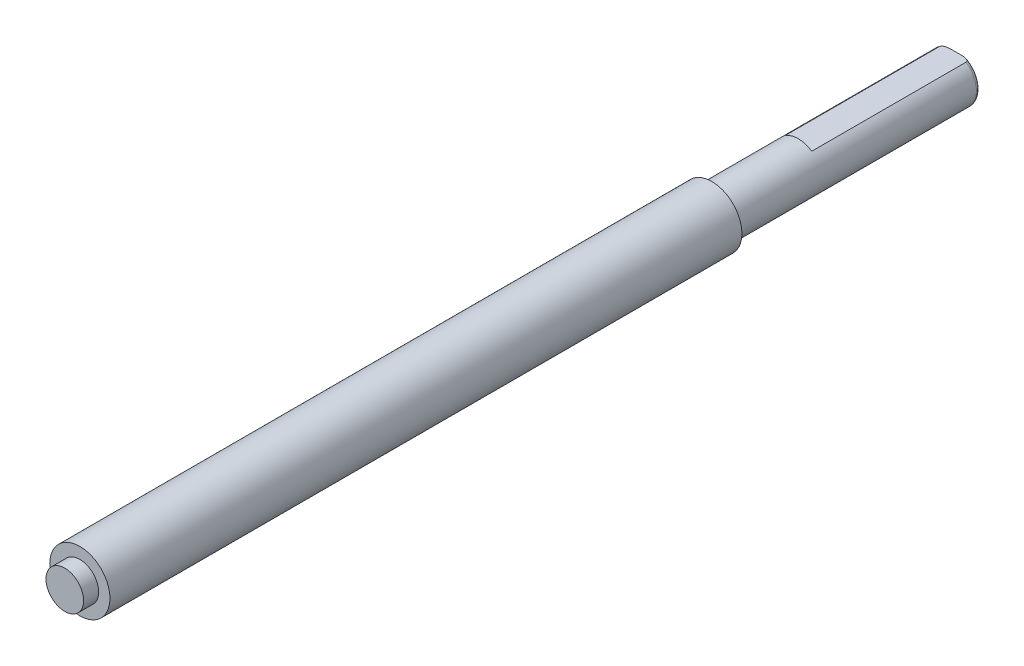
ISO-10303-21;
HEADER;
FILE_DESCRIPTION(('STEP AP214'),'2;1');
FILE_NAME('part.step','',(''),(''),'','','');
FILE_SCHEMA(('AUTOMOTIVE_DESIGN { 1 0 10303 214 1 1 1 1 }'));
ENDSEC;
DATA;
#1=APPLICATION_CONTEXT('core data for automotive mechanical design processes');
#2=APPLICATION_PROTOCOL_DEFINITION('international standard','automotive_design',2000,#1);
#3=PRODUCT_CONTEXT('',#1,'mechanical');
#4=PRODUCT('Part','Part','',(#3));
#5=PRODUCT_RELATED_PRODUCT_CATEGORY('part','',(#4));
#6=PRODUCT_DEFINITION_FORMATION('','',#4);
#7=PRODUCT_DEFINITION_CONTEXT('part definition',#1,'design');
#8=PRODUCT_DEFINITION('design','',#6,#7);
#9=PRODUCT_DEFINITION_SHAPE('','',#8);
#10=(LENGTH_UNIT() NAMED_UNIT(*) SI_UNIT(.MILLI.,.METRE.));
#11=(NAMED_UNIT(*) PLANE_ANGLE_UNIT() SI_UNIT($,.RADIAN.));
#12=(NAMED_UNIT(*) SI_UNIT($,.STERADIAN.) SOLID_ANGLE_UNIT());
#13=UNCERTAINTY_MEASURE_WITH_UNIT(LENGTH_MEASURE(1.E-05),#10,'distance_accuracy_value','');
#14=(GEOMETRIC_REPRESENTATION_CONTEXT(3) GLOBAL_UNCERTAINTY_ASSIGNED_CONTEXT((#13)) GLOBAL_UNIT_ASSIGNED_CONTEXT((#10,
#11,#12)) REPRESENTATION_CONTEXT('',''));
#15=CARTESIAN_POINT('',(0.,0.,0.));
#16=DIRECTION('',(0.,0.,1.));
#17=DIRECTION('',(1.,0.,0.));
#18=AXIS2_PLACEMENT_3D('',#15,#16,#17);
#19=CARTESIAN_POINT('',(0.,0.,116.5));
#20=DIRECTION('',(0.,0.,1.));
#21=DIRECTION('',(1.,0.,0.));
#22=AXIS2_PLACEMENT_3D('',#19,#20,#21);
#23=PLANE('',#22);
#24=CARTESIAN_POINT('',(0.,0.,116.5));
#25=DIRECTION('',(0.,0.,1.));
#26=DIRECTION('',(1.,0.,0.));
#27=AXIS2_PLACEMENT_3D('',#24,#25,#26);
#28=CIRCLE('',#27,4.);
#29=CARTESIAN_POINT('',(-4.,0.,116.5));
#30=VERTEX_POINT('',#29);
#31=EDGE_CURVE('E88',#30,#30,#28,.T.);
#32=ORIENTED_EDGE('',*,*,#31,.T.);
#33=EDGE_LOOP('',(#32));
#34=FACE_BOUND('',#33,.T.);
#35=CARTESIAN_POINT('',(0.,0.,116.5));
#36=DIRECTION('',(0.,0.,1.));
#37=DIRECTION('',(1.,0.,0.));
#38=AXIS2_PLACEMENT_3D('',#35,#36,#37);
#39=CIRCLE('',#38,2.5);
#40=CARTESIAN_POINT('',(2.5,0.,116.5));
#41=VERTEX_POINT('',#40);
#42=EDGE_CURVE('E201',#41,#41,#39,.T.);
#43=ORIENTED_EDGE('',*,*,#42,.F.);
#44=EDGE_LOOP('',(#43));
#45=FACE_BOUND('',#44,.T.);
#46=ADVANCED_FACE('F33',(#34,#45),#23,.T.);
#47=CARTESIAN_POINT('',(0.,0.,32.5));
#48=DIRECTION('',(0.,0.,-1.));
#49=DIRECTION('',(-1.,0.,0.));
#50=AXIS2_PLACEMENT_3D('',#47,#48,#49);
#51=CYLINDRICAL_SURFACE('',#50,3.175);
#52=CARTESIAN_POINT('',(0.,0.,32.5));
#53=DIRECTION('',(0.,0.,1.));
#54=DIRECTION('',(1.,0.,0.));
#55=AXIS2_PLACEMENT_3D('',#52,#53,#54);
#56=CIRCLE('',#55,3.175);
#57=CARTESIAN_POINT('',(3.175,0.,32.5));
#58=VERTEX_POINT('',#57);
#59=EDGE_CURVE('E91',#58,#58,#56,.T.);
#60=ORIENTED_EDGE('',*,*,#59,.F.);
#61=EDGE_LOOP('',(#60));
#62=FACE_BOUND('',#61,.T.);
#63=DIRECTION('',(0.,0.,-1.));
#64=VECTOR('',#63,1.);
#65=CARTESIAN_POINT('',(-1.78605710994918,2.625,21.));
#66=LINE('',#65,#64);
#67=CARTESIAN_POINT('',(-1.78605710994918,2.625,21.));
#68=VERTEX_POINT('',#67);
#69=CARTESIAN_POINT('',(-1.78605710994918,2.625,0.500000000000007));
#70=VERTEX_POINT('',#69);
#71=EDGE_CURVE('E77',#68,#70,#66,.T.);
#72=ORIENTED_EDGE('',*,*,#71,.T.);
#73=CARTESIAN_POINT('',(0.,0.,0.5));
#74=DIRECTION('',(0.,0.,1.));
#75=DIRECTION('',(1.,0.,0.));
#76=AXIS2_PLACEMENT_3D('',#73,#74,#75);
#77=CIRCLE('',#76,3.175);
#78=CARTESIAN_POINT('',(1.78605710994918,2.625,0.500000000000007));
#79=VERTEX_POINT('',#78);
#80=EDGE_CURVE('E82',#70,#79,#77,.T.);
#81=ORIENTED_EDGE('',*,*,#80,.T.);
#82=DIRECTION('',(0.,0.,-1.));
#83=VECTOR('',#82,1.);
#84=CARTESIAN_POINT('',(1.78605710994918,2.625,21.));
#85=LINE('',#84,#83);
#86=CARTESIAN_POINT('',(1.78605710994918,2.625,21.));
#87=VERTEX_POINT('',#86);
#88=EDGE_CURVE('E76',#87,#79,#85,.T.);
#89=ORIENTED_EDGE('',*,*,#88,.F.);
#90=CARTESIAN_POINT('',(0.,0.,21.));
#91=DIRECTION('',(0.,0.,-1.));
#92=DIRECTION('',(-1.,0.,0.));
#93=AXIS2_PLACEMENT_3D('',#90,#91,#92);
#94=CIRCLE('',#93,3.175);
#95=EDGE_CURVE('E66',#68,#87,#94,.T.);
#96=ORIENTED_EDGE('',*,*,#95,.F.);
#97=EDGE_LOOP('',(#72,#81,#89,#96));
#98=FACE_BOUND('',#97,.T.);
#99=ADVANCED_FACE('F80',(#62,#98),#51,.T.);
#100=CARTESIAN_POINT('',(0.,0.,0.));
#101=DIRECTION('',(0.,0.,1.));
#102=DIRECTION('',(1.,0.,0.));
#103=AXIS2_PLACEMENT_3D('',#100,#101,#102);
#104=PLANE('',#103);
#105=DIRECTION('',(-1.,0.,0.));
#106=VECTOR('',#105,1.);
#107=CARTESIAN_POINT('',(1.78605710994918,2.625,0.));
#108=LINE('',#107,#106);
#109=CARTESIAN_POINT('',(0.514781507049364,2.625,0.));
#110=VERTEX_POINT('',#109);
#111=CARTESIAN_POINT('',(-0.514781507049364,2.625,0.));
#112=VERTEX_POINT('',#111);
#113=EDGE_CURVE('E73',#110,#112,#108,.T.);
#114=ORIENTED_EDGE('',*,*,#113,.F.);
#115=CARTESIAN_POINT('',(0.,0.,0.));
#116=DIRECTION('',(0.,0.,1.));
#117=DIRECTION('',(1.,0.,0.));
#118=AXIS2_PLACEMENT_3D('',#115,#116,#117);
#119=CIRCLE('',#118,2.675);
#120=EDGE_CURVE('E11',#110,#112,#119,.F.);
#121=ORIENTED_EDGE('',*,*,#120,.T.);
#122=EDGE_LOOP('',(#114,#121));
#123=FACE_BOUND('',#122,.T.);
#124=ADVANCED_FACE('F118',(#123),#104,.F.);
#125=CARTESIAN_POINT('',(0.,0.,32.5));
#126=DIRECTION('',(0.,0.,1.));
#127=DIRECTION('',(1.,0.,0.));
#128=AXIS2_PLACEMENT_3D('',#125,#126,#127);
#129=PLANE('',#128);
#130=CARTESIAN_POINT('',(0.,0.,32.5));
#131=DIRECTION('',(0.,0.,1.));
#132=DIRECTION('',(1.,0.,0.));
#133=AXIS2_PLACEMENT_3D('',#130,#131,#132);
#134=CIRCLE('',#133,4.);
#135=CARTESIAN_POINT('',(-4.,0.,32.5));
#136=VERTEX_POINT('',#135);
#137=EDGE_CURVE('E84',#136,#136,#134,.T.);
#138=ORIENTED_EDGE('',*,*,#137,.F.);
#139=EDGE_LOOP('',(#138));
#140=FACE_BOUND('',#139,.T.);
#141=ORIENTED_EDGE('',*,*,#59,.T.);
#142=EDGE_LOOP('',(#141));
#143=FACE_BOUND('',#142,.T.);
#144=ADVANCED_FACE('F115',(#140,#143),#129,.F.);
#145=CARTESIAN_POINT('',(0.,0.,116.5));
#146=DIRECTION('',(0.,0.,-1.));
#147=DIRECTION('',(-1.,0.,0.));
#148=AXIS2_PLACEMENT_3D('',#145,#146,#147);
#149=CYLINDRICAL_SURFACE('',#148,4.);
#150=CARTESIAN_POINT('',(-4.,0.,116.5));
#151=CARTESIAN_POINT('',(-4.,0.,115.625));
#152=CARTESIAN_POINT('',(-4.,0.,114.75));
#153=CARTESIAN_POINT('',(-4.,0.,113.));
#154=CARTESIAN_POINT('',(-4.,0.,112.125));
#155=CARTESIAN_POINT('',(-4.,0.,110.375));
#156=CARTESIAN_POINT('',(-4.,0.,109.5));
#157=CARTESIAN_POINT('',(-4.,0.,107.75));
#158=CARTESIAN_POINT('',(-4.,0.,106.875));
#159=CARTESIAN_POINT('',(-4.,0.,105.125));
#160=CARTESIAN_POINT('',(-4.,0.,104.25));
#161=CARTESIAN_POINT('',(-4.,0.,102.5));
#162=CARTESIAN_POINT('',(-4.,0.,101.625));
#163=CARTESIAN_POINT('',(-4.,0.,99.875));
#164=CARTESIAN_POINT('',(-4.,0.,99.));
#165=CARTESIAN_POINT('',(-4.,0.,97.25));
#166=CARTESIAN_POINT('',(-4.,0.,96.375));
#167=CARTESIAN_POINT('',(-4.,0.,94.625));
#168=CARTESIAN_POINT('',(-4.,0.,93.75));
#169=CARTESIAN_POINT('',(-4.,0.,92.));
#170=CARTESIAN_POINT('',(-4.,0.,91.125));
#171=CARTESIAN_POINT('',(-4.,0.,89.375));
#172=CARTESIAN_POINT('',(-4.,0.,88.5));
#173=CARTESIAN_POINT('',(-4.,0.,86.75));
#174=CARTESIAN_POINT('',(-4.,0.,85.875));
#175=CARTESIAN_POINT('',(-4.,0.,84.125));
#176=CARTESIAN_POINT('',(-4.,0.,83.25));
#177=CARTESIAN_POINT('',(-4.,0.,81.5));
#178=CARTESIAN_POINT('',(-4.,0.,80.625));
#179=CARTESIAN_POINT('',(-4.,0.,78.875));
#180=CARTESIAN_POINT('',(-4.,0.,78.));
#181=CARTESIAN_POINT('',(-4.,0.,76.25));
#182=CARTESIAN_POINT('',(-4.,0.,75.375));
#183=CARTESIAN_POINT('',(-4.,0.,73.625));
#184=CARTESIAN_POINT('',(-4.,0.,72.75));
#185=CARTESIAN_POINT('',(-4.,0.,71.));
#186=CARTESIAN_POINT('',(-4.,0.,70.125));
#187=CARTESIAN_POINT('',(-4.,0.,68.375));
#188=CARTESIAN_POINT('',(-4.,0.,67.5));
#189=CARTESIAN_POINT('',(-4.,0.,65.75));
#190=CARTESIAN_POINT('',(-4.,0.,64.875));
#191=CARTESIAN_POINT('',(-4.,0.,63.125));
#192=CARTESIAN_POINT('',(-4.,0.,62.25));
#193=CARTESIAN_POINT('',(-4.,0.,60.5));
#194=CARTESIAN_POINT('',(-4.,0.,59.625));
#195=CARTESIAN_POINT('',(-4.,0.,57.875));
#196=CARTESIAN_POINT('',(-4.,0.,57.));
#197=CARTESIAN_POINT('',(-4.,0.,55.25));
#198=CARTESIAN_POINT('',(-4.,0.,54.375));
#199=CARTESIAN_POINT('',(-4.,0.,52.625));
#200=CARTESIAN_POINT('',(-4.,0.,51.75));
#201=CARTESIAN_POINT('',(-4.,0.,50.));
#202=CARTESIAN_POINT('',(-4.,0.,49.125));
#203=CARTESIAN_POINT('',(-4.,0.,47.375));
#204=CARTESIAN_POINT('',(-4.,0.,46.5));
#205=CARTESIAN_POINT('',(-4.,0.,44.75));
#206=CARTESIAN_POINT('',(-4.,0.,43.875));
#207=CARTESIAN_POINT('',(-4.,0.,42.125));
#208=CARTESIAN_POINT('',(-4.,0.,41.25));
#209=CARTESIAN_POINT('',(-4.,0.,39.5));
#210=CARTESIAN_POINT('',(-4.,0.,38.625));
#211=CARTESIAN_POINT('',(-4.,0.,36.875));
#212=CARTESIAN_POINT('',(-4.,0.,36.));
#213=CARTESIAN_POINT('',(-4.,0.,34.25));
#214=CARTESIAN_POINT('',(-4.,0.,33.375));
#215=CARTESIAN_POINT('',(-4.,0.,32.5));
#216=B_SPLINE_CURVE_WITH_KNOTS('',3,(#150,#151,#152,#153,#154,#155,#156,#157,#158,#159,#160,
#161,#162,#163,#164,#165,#166,#167,#168,#169,#170,#171,#172,#173,#174,#175,#176,#177,#178,#179,
#180,#181,#182,#183,#184,#185,#186,#187,#188,#189,#190,#191,#192,#193,#194,#195,#196,#197,#198,
#199,#200,#201,#202,#203,#204,#205,#206,#207,#208,#209,#210,#211,#212,#213,#214,#215),
.UNSPECIFIED.,.F.,.F.,(4,2,2,2,2,2,2,2,2,2,2,2,2,2,2,2,2,2,2,2,2,2,2,2,2,2,2,2,2,2,2,2,4),(0.,
2.62499999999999,5.24999999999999,7.87499999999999,10.5,13.125,15.75,18.375,21.,23.625,26.25,
28.875,31.5,34.125,36.75,39.375,42.,44.625,47.25,49.875,52.5,55.125,57.75,60.375,63.,65.625,
68.25,70.875,73.5,76.125,78.75,81.375,84.),.UNSPECIFIED.);
#217=EDGE_CURVE('BSEAM109',#30,#136,#216,.T.);
#218=ORIENTED_EDGE('',*,*,#31,.F.);
#219=ORIENTED_EDGE('',*,*,#137,.T.);
#220=ORIENTED_EDGE('',*,*,#217,.T.);
#221=ORIENTED_EDGE('',*,*,#217,.F.);
#222=EDGE_LOOP('',(#218,#220,#219,#221));
#223=FACE_BOUND('',#222,.T.);
#224=ADVANCED_FACE('F109',(#223),#149,.T.);
#225=CARTESIAN_POINT('',(1.78605710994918,2.625,21.));
#226=DIRECTION('',(0.,-1.,0.));
#227=DIRECTION('',(0.,0.,-1.));
#228=AXIS2_PLACEMENT_3D('',#225,#226,#227);
#229=PLANE('',#228);
#230=ORIENTED_EDGE('',*,*,#88,.T.);
#231=CARTESIAN_POINT('',(1.78605710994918,2.625,0.5));
#232=CARTESIAN_POINT('',(1.7861183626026,2.625,0.480515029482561));
#233=CARTESIAN_POINT('',(1.78403706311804,2.625,0.461106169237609));
#234=CARTESIAN_POINT('',(1.77614566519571,2.625,0.423291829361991));
#235=CARTESIAN_POINT('',(1.77038040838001,2.625,0.404877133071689));
#236=CARTESIAN_POINT('',(1.75568721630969,2.625,0.369486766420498));
#237=CARTESIAN_POINT('',(1.74677356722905,2.625,0.352505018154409));
#238=CARTESIAN_POINT('',(1.72641804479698,2.625,0.320088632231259));
#239=CARTESIAN_POINT('',(1.71496821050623,2.625,0.304659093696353));
#240=CARTESIAN_POINT('',(1.68383170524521,2.625,0.26803343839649));
#241=CARTESIAN_POINT('',(1.66291485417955,2.625,0.247887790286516));
#242=CARTESIAN_POINT('',(1.61825721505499,2.625,0.211090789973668));
#243=CARTESIAN_POINT('',(1.59451232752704,2.625,0.194444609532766));
#244=CARTESIAN_POINT('',(1.52776741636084,2.625,0.153457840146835));
#245=CARTESIAN_POINT('',(1.48301267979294,2.625,0.131986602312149));
#246=CARTESIAN_POINT('',(1.41389871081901,2.625,0.104695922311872));
#247=CARTESIAN_POINT('',(1.39041958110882,2.625,0.0963921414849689));
#248=CARTESIAN_POINT('',(1.34299986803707,2.625,0.0812423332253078));
#249=CARTESIAN_POINT('',(1.31905952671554,2.625,0.074395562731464));
#250=CARTESIAN_POINT('',(1.23008070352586,2.625,0.0514093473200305));
#251=CARTESIAN_POINT('',(1.16404779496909,2.625,0.0391500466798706));
#252=CARTESIAN_POINT('',(1.03103589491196,2.625,0.0205768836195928));
#253=CARTESIAN_POINT('',(0.964054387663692,2.625,0.0142841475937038));
#254=CARTESIAN_POINT('',(0.833124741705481,2.625,0.00573297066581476));
#255=CARTESIAN_POINT('',(0.769187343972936,2.625,0.00329337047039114));
#256=CARTESIAN_POINT('',(0.67349457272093,2.625,0.0011481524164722));
#257=CARTESIAN_POINT('',(0.641749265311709,2.625,0.000684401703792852));
#258=CARTESIAN_POINT('',(0.578263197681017,2.625,0.000111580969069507));
#259=CARTESIAN_POINT('',(0.546522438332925,2.625,2.42149440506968E-06));
#260=CARTESIAN_POINT('',(0.514781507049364,2.625,0.));
#261=B_SPLINE_CURVE_WITH_KNOTS('',3,(#231,#232,#233,#234,#235,#236,#237,#238,#239,#240,#241,
#242,#243,#244,#245,#246,#247,#248,#249,#250,#251,#252,#253,#254,#255,#256,#257,#258,#259,#260),
.UNSPECIFIED.,.F.,.F.,(4,2,2,2,2,2,2,2,2,2,2,2,2,2,4),(0.,0.0582234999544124,0.115751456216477,
0.173021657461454,0.230474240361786,0.317101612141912,0.403856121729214,0.551884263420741,
0.62657755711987,0.701232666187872,0.90221485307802,1.10390604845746,1.29579765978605,
1.39104324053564,1.48626479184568),.UNSPECIFIED.);
#262=EDGE_CURVE('E42',#79,#110,#261,.T.);
#263=ORIENTED_EDGE('',*,*,#262,.T.);
#264=ORIENTED_EDGE('',*,*,#113,.T.);
#265=CARTESIAN_POINT('',(-0.514781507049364,2.625,0.));
#266=CARTESIAN_POINT('',(-0.545138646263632,2.625,1.99675866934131E-06));
#267=CARTESIAN_POINT('',(-0.575495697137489,2.625,0.00010207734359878));
#268=CARTESIAN_POINT('',(-0.63621318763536,2.625,0.000620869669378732));
#269=CARTESIAN_POINT('',(-0.666573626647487,2.625,0.00103964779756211));
#270=CARTESIAN_POINT('',(-0.757972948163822,2.625,0.00296465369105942));
#271=CARTESIAN_POINT('',(-0.819003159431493,2.625,0.00514219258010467));
#272=CARTESIAN_POINT('',(-0.941825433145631,2.625,0.0125778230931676));
#273=CARTESIAN_POINT('',(-1.00361494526,2.625,0.0178823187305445));
#274=CARTESIAN_POINT('',(-1.12651560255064,2.625,0.0332527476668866));
#275=CARTESIAN_POINT('',(-1.18762806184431,2.625,0.0433066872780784));
#276=CARTESIAN_POINT('',(-1.28243856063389,2.625,0.0645844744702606));
#277=CARTESIAN_POINT('',(-1.31665689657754,2.625,0.0734587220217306));
#278=CARTESIAN_POINT('',(-1.38423460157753,2.625,0.0940301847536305));
#279=CARTESIAN_POINT('',(-1.41759448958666,2.625,0.105725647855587));
#280=CARTESIAN_POINT('',(-1.48318231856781,2.625,0.132705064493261));
#281=CARTESIAN_POINT('',(-1.51539860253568,2.625,0.148017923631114));
#282=CARTESIAN_POINT('',(-1.57740901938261,2.625,0.182992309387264));
#283=CARTESIAN_POINT('',(-1.60720754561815,2.625,0.202645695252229));
#284=CARTESIAN_POINT('',(-1.65201841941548,2.625,0.238603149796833));
#285=CARTESIAN_POINT('',(-1.66831627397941,2.625,0.253297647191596));
#286=CARTESIAN_POINT('',(-1.69872512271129,2.625,0.28482495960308));
#287=CARTESIAN_POINT('',(-1.71283757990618,2.625,0.301656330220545));
#288=CARTESIAN_POINT('',(-1.73617877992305,2.625,0.334788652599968));
#289=CARTESIAN_POINT('',(-1.74582188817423,2.625,0.350794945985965));
#290=CARTESIAN_POINT('',(-1.76232487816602,2.625,0.38416491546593));
#291=CARTESIAN_POINT('',(-1.76919194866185,2.625,0.401524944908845));
#292=CARTESIAN_POINT('',(-1.77820439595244,2.625,0.432417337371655));
#293=CARTESIAN_POINT('',(-1.78112252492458,2.625,0.445725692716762));
#294=CARTESIAN_POINT('',(-1.78506131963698,2.625,0.472682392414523));
#295=CARTESIAN_POINT('',(-1.78607295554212,2.625,0.486332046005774));
#296=CARTESIAN_POINT('',(-1.78605710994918,2.625,0.500000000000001));
#297=B_SPLINE_CURVE_WITH_KNOTS('',3,(#265,#266,#267,#268,#269,#270,#271,#272,#273,#274,#275,
#276,#277,#278,#279,#280,#281,#282,#283,#284,#285,#286,#287,#288,#289,#290,#291,#292,#293,#294,
#295,#296),.UNSPECIFIED.,.F.,.F.,(4,2,2,2,2,2,2,2,2,2,2,2,2,2,2,4),(0.,0.091070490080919,
0.182159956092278,0.365318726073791,0.551266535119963,0.736747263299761,0.842706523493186,
0.948600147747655,1.05537040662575,1.16194209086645,1.22761113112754,1.2932360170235,
1.34908253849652,1.40478350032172,1.44552659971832,1.4864621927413),.UNSPECIFIED.);
#298=EDGE_CURVE('E97',#112,#70,#297,.T.);
#299=ORIENTED_EDGE('',*,*,#298,.T.);
#300=ORIENTED_EDGE('',*,*,#71,.F.);
#301=DIRECTION('',(-1.,0.,0.));
#302=VECTOR('',#301,1.);
#303=CARTESIAN_POINT('',(1.78605710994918,2.625,21.));
#304=LINE('',#303,#302);
#305=EDGE_CURVE('E69',#87,#68,#304,.T.);
#306=ORIENTED_EDGE('',*,*,#305,.F.);
#307=EDGE_LOOP('',(#230,#263,#264,#299,#300,#306));
#308=FACE_BOUND('',#307,.T.);
#309=ADVANCED_FACE('F75',(#308),#229,.F.);
#310=CARTESIAN_POINT('',(0.,0.,21.));
#311=DIRECTION('',(0.,0.,-1.));
#312=DIRECTION('',(-1.,0.,0.));
#313=AXIS2_PLACEMENT_3D('',#310,#311,#312);
#314=PLANE('',#313);
#315=ORIENTED_EDGE('',*,*,#95,.T.);
#316=ORIENTED_EDGE('',*,*,#305,.T.);
#317=EDGE_LOOP('',(#315,#316));
#318=FACE_BOUND('',#317,.T.);
#319=ADVANCED_FACE('F68',(#318),#314,.T.);
#320=CARTESIAN_POINT('',(0.,0.,0.5));
#321=DIRECTION('',(0.,0.,1.));
#322=DIRECTION('',(1.,0.,0.));
#323=AXIS2_PLACEMENT_3D('',#320,#321,#322);
#324=TOROIDAL_SURFACE('',#323,2.675,0.5);
#325=ORIENTED_EDGE('',*,*,#298,.F.);
#326=ORIENTED_EDGE('',*,*,#120,.F.);
#327=ORIENTED_EDGE('',*,*,#262,.F.);
#328=ORIENTED_EDGE('',*,*,#80,.F.);
#329=EDGE_LOOP('',(#325,#326,#327,#328));
#330=FACE_BOUND('',#329,.T.);
#331=ADVANCED_FACE('F35',(#330),#324,.T.);
#332=CARTESIAN_POINT('',(0.,0.,118.5));
#333=DIRECTION('',(0.,0.,-1.));
#334=DIRECTION('',(-1.,0.,0.));
#335=AXIS2_PLACEMENT_3D('',#332,#333,#334);
#336=CYLINDRICAL_SURFACE('',#335,2.5);
#337=CARTESIAN_POINT('',(0.,0.,118.5));
#338=DIRECTION('',(0.,0.,1.));
#339=DIRECTION('',(1.,0.,0.));
#340=AXIS2_PLACEMENT_3D('',#337,#338,#339);
#341=CIRCLE('',#340,2.5);
#342=CARTESIAN_POINT('',(2.5,0.,118.5));
#343=VERTEX_POINT('',#342);
#344=EDGE_CURVE('E200',#343,#343,#341,.T.);
#345=ORIENTED_EDGE('',*,*,#344,.F.);
#346=EDGE_LOOP('',(#345));
#347=FACE_BOUND('',#346,.T.);
#348=ORIENTED_EDGE('',*,*,#42,.T.);
#349=EDGE_LOOP('',(#348));
#350=FACE_BOUND('',#349,.T.);
#351=ADVANCED_FACE('F159',(#347,#350),#336,.T.);
#352=CARTESIAN_POINT('',(0.,0.,118.5));
#353=DIRECTION('',(0.,0.,1.));
#354=DIRECTION('',(1.,0.,0.));
#355=AXIS2_PLACEMENT_3D('',#352,#353,#354);
#356=PLANE('',#355);
#357=ORIENTED_EDGE('',*,*,#344,.T.);
#358=EDGE_LOOP('',(#357));
#359=FACE_BOUND('',#358,.T.);
#360=ADVANCED_FACE('F166',(#359),#356,.T.);
#361=CLOSED_SHELL('',(#46,#99,#124,#144,#224,#309,#319,#331,#351,#360));
#362=MANIFOLD_SOLID_BREP('B2',#361);
#363=ADVANCED_BREP_SHAPE_REPRESENTATION('',(#18,#362),#14);
#364=SHAPE_DEFINITION_REPRESENTATION(#9,#363);
ENDSEC;
END-ISO-10303-21;
